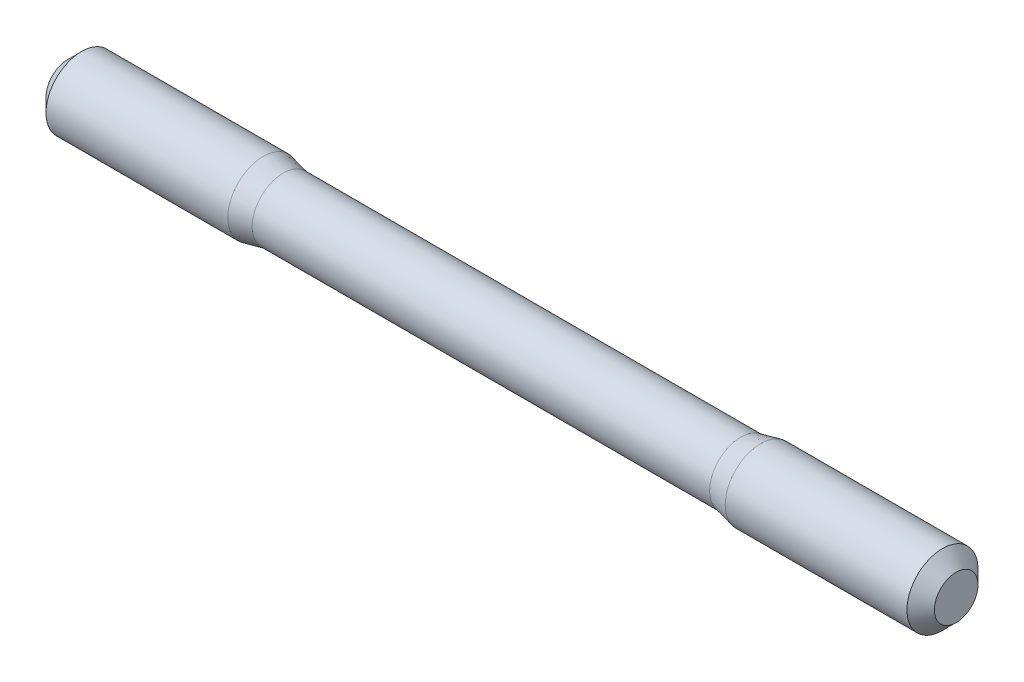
from build123d import *

# Parameters (mm, degrees)
HEADCHAMFER_SIZE = 1.5415


with BuildPart() as part:
    # Sketch1 → Base (revolve)
    with BuildSketch(Plane.XY, mode=Mode.PRIVATE) as base_sk:
        Polygon((0, 0), (0, 4), (22, 4), (24.25, 3.5), (75.75, 3.5), (78, 4), (100, 4), (100, 0), align=None)
    revolve(base_sk.sketch.rotate(Axis((-1.310841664, 0, 0), (1, 0, 0)), 90), axis=Axis((-1.310841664, 0, 0), (1, 0, 0)))

    # HeadChamfer
    headchamfer_edges = [part.edges().sort_by_distance(p)[0] for p in [
        (100, 0, -4),
        (0, 0, -4),
    ]]
    chamfer(headchamfer_edges, length=HEADCHAMFER_SIZE)


solid = part.part
